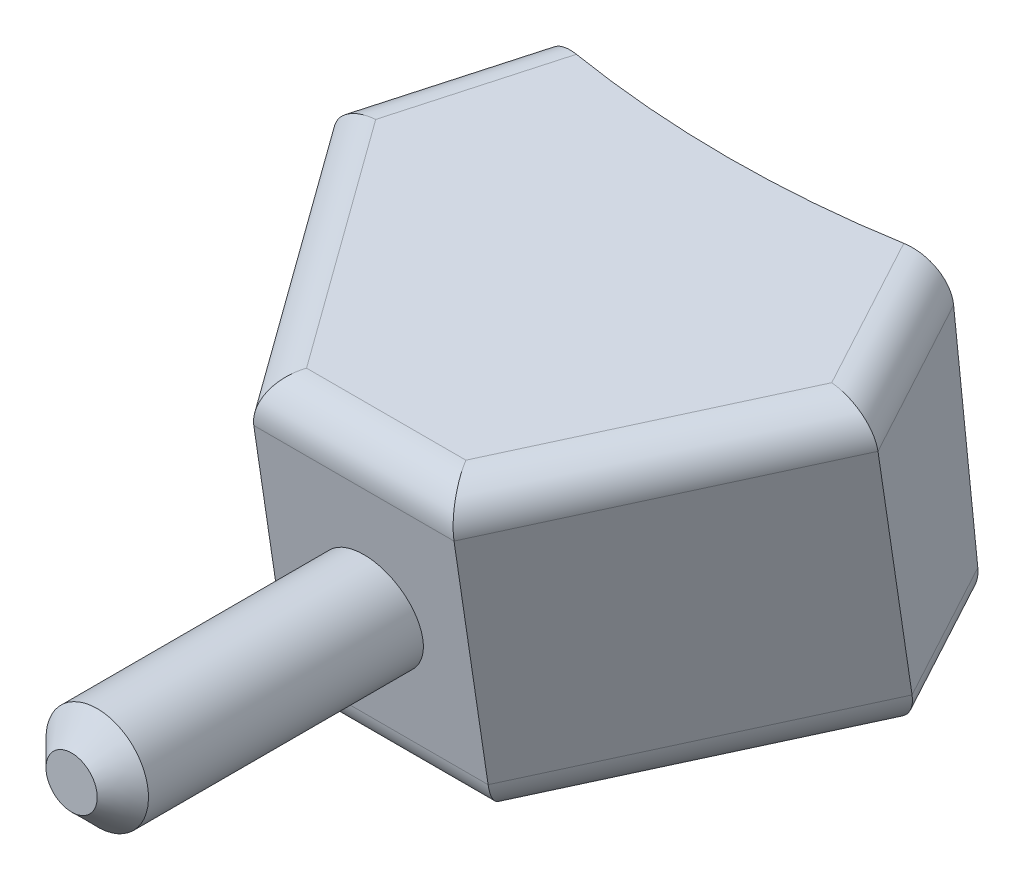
ISO-10303-21;
HEADER;
FILE_DESCRIPTION(('STEP AP214'),'2;1');
FILE_NAME('part.step','',(''),(''),'','','');
FILE_SCHEMA(('AUTOMOTIVE_DESIGN { 1 0 10303 214 1 1 1 1 }'));
ENDSEC;
DATA;
#1=APPLICATION_CONTEXT('core data for automotive mechanical design processes');
#2=APPLICATION_PROTOCOL_DEFINITION('international standard','automotive_design',2000,#1);
#3=PRODUCT_CONTEXT('',#1,'mechanical');
#4=PRODUCT('Part','Part','',(#3));
#5=PRODUCT_RELATED_PRODUCT_CATEGORY('part','',(#4));
#6=PRODUCT_DEFINITION_FORMATION('','',#4);
#7=PRODUCT_DEFINITION_CONTEXT('part definition',#1,'design');
#8=PRODUCT_DEFINITION('design','',#6,#7);
#9=PRODUCT_DEFINITION_SHAPE('','',#8);
#10=(LENGTH_UNIT() NAMED_UNIT(*) SI_UNIT(.MILLI.,.METRE.));
#11=(NAMED_UNIT(*) PLANE_ANGLE_UNIT() SI_UNIT($,.RADIAN.));
#12=(NAMED_UNIT(*) SI_UNIT($,.STERADIAN.) SOLID_ANGLE_UNIT());
#13=UNCERTAINTY_MEASURE_WITH_UNIT(LENGTH_MEASURE(1.E-05),#10,'distance_accuracy_value','');
#14=(GEOMETRIC_REPRESENTATION_CONTEXT(3) GLOBAL_UNCERTAINTY_ASSIGNED_CONTEXT((#13)) GLOBAL_UNIT_ASSIGNED_CONTEXT((#10,
#11,#12)) REPRESENTATION_CONTEXT('',''));
#15=CARTESIAN_POINT('',(0.,0.,0.));
#16=DIRECTION('',(0.,0.,1.));
#17=DIRECTION('',(1.,0.,0.));
#18=AXIS2_PLACEMENT_3D('',#15,#16,#17);
#19=CARTESIAN_POINT('',(1.95405117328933,-2.88864232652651,-0.468050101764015));
#20=DIRECTION('',(0.829037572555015,-0.0826539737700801,0.553050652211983));
#21=DIRECTION('',(0.554949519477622,0.,-0.831884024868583));
#22=AXIS2_PLACEMENT_3D('',#19,#20,#21);
#23=PLANE('',#22);
#24=DIRECTION('',(0.,0.98901586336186,0.14780941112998));
#25=VECTOR('',#24,1.);
#26=CARTESIAN_POINT('',(5.3092085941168,-2.15340499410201,-5.38763796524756));
#27=LINE('',#26,#25);
#28=CARTESIAN_POINT('',(5.30920859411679,-1.41164309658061,-5.27678090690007));
#29=VERTEX_POINT('',#28);
#30=CARTESIAN_POINT('',(5.30920859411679,3.03892828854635,-4.61163855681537));
#31=VERTEX_POINT('',#30);
#32=EDGE_CURVE('E133',#29,#31,#27,.T.);
#33=ORIENTED_EDGE('',*,*,#32,.T.);
#34=DIRECTION('',(0.559192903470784,0.122539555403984,-0.81993131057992));
#35=VECTOR('',#34,1.);
#36=CARTESIAN_POINT('',(1.95405117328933,2.30369095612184,0.307949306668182));
#37=LINE('',#36,#35);
#38=CARTESIAN_POINT('',(1.95405117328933,2.30369095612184,0.307949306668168));
#39=VERTEX_POINT('',#38);
#40=EDGE_CURVE('E223',#31,#39,#37,.F.);
#41=ORIENTED_EDGE('',*,*,#40,.T.);
#42=DIRECTION('',(0.,0.98901586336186,0.14780941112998));
#43=VECTOR('',#42,1.);
#44=CARTESIAN_POINT('',(1.95405117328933,-2.88864232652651,-0.468050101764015));
#45=LINE('',#44,#43);
#46=CARTESIAN_POINT('',(1.95405117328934,-2.14688042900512,-0.357193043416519));
#47=VERTEX_POINT('',#46);
#48=EDGE_CURVE('E135',#47,#39,#45,.T.);
#49=ORIENTED_EDGE('',*,*,#48,.F.);
#50=DIRECTION('',(0.559192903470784,0.122539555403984,-0.81993131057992));
#51=VECTOR('',#50,1.);
#52=CARTESIAN_POINT('',(1.95405117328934,-2.14688042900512,-0.357193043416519));
#53=LINE('',#52,#51);
#54=EDGE_CURVE('E131',#47,#29,#53,.T.);
#55=ORIENTED_EDGE('',*,*,#54,.T.);
#56=EDGE_LOOP('',(#33,#41,#49,#55));
#57=FACE_BOUND('',#56,.T.);
#58=ADVANCED_FACE('F38',(#57),#23,.T.);
#59=CARTESIAN_POINT('',(-1.95405117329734,-2.8886423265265,-0.468050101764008));
#60=DIRECTION('',(0.,-0.147809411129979,0.989015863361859));
#61=DIRECTION('',(0.,-0.989015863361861,-0.14780941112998));
#62=AXIS2_PLACEMENT_3D('',#59,#60,#61);
#63=PLANE('',#62);
#64=CARTESIAN_POINT('',(0.,0.,-0.0363396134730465));
#65=DIRECTION('',(0.,-0.147809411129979,0.989015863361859));
#66=DIRECTION('',(0.,0.989015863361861,0.14780941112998));
#67=AXIS2_PLACEMENT_3D('',#64,#65,#66);
#68=ELLIPSE('',#67,1.01110612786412,1.);
#69=CARTESIAN_POINT('',(0.,0.999999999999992,0.113111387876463));
#70=VERTEX_POINT('',#69);
#71=EDGE_CURVE('E168',#70,#70,#68,.T.);
#72=ORIENTED_EDGE('',*,*,#71,.F.);
#73=EDGE_LOOP('',(#72));
#74=FACE_BOUND('',#73,.T.);
#75=ORIENTED_EDGE('',*,*,#48,.T.);
#76=DIRECTION('',(0.999999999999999,0.,0.));
#77=VECTOR('',#76,1.);
#78=CARTESIAN_POINT('',(-1.95405117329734,2.30369095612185,0.307949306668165));
#79=LINE('',#78,#77);
#80=CARTESIAN_POINT('',(-1.95405117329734,2.30369095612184,0.307949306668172));
#81=VERTEX_POINT('',#80);
#82=EDGE_CURVE('E53',#39,#81,#79,.F.);
#83=ORIENTED_EDGE('',*,*,#82,.T.);
#84=DIRECTION('',(0.,0.98901586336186,0.14780941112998));
#85=VECTOR('',#84,1.);
#86=CARTESIAN_POINT('',(-1.95405117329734,-2.8886423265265,-0.468050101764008));
#87=LINE('',#86,#85);
#88=CARTESIAN_POINT('',(-1.95405117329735,-2.14688042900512,-0.357193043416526));
#89=VERTEX_POINT('',#88);
#90=EDGE_CURVE('E289',#89,#81,#87,.T.);
#91=ORIENTED_EDGE('',*,*,#90,.F.);
#92=DIRECTION('',(0.999999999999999,0.,0.));
#93=VECTOR('',#92,1.);
#94=CARTESIAN_POINT('',(-1.95405117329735,-2.14688042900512,-0.357193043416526));
#95=LINE('',#94,#93);
#96=EDGE_CURVE('E140',#89,#47,#95,.T.);
#97=ORIENTED_EDGE('',*,*,#96,.T.);
#98=EDGE_LOOP('',(#75,#83,#91,#97));
#99=FACE_BOUND('',#98,.T.);
#100=ADVANCED_FACE('F249',(#74,#99),#63,.T.);
#101=CARTESIAN_POINT('',(-5.30920859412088,-2.15340499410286,-5.38763796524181));
#102=DIRECTION('',(-0.829037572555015,-0.0826539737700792,0.553050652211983));
#103=DIRECTION('',(0.554949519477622,0.,0.831884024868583));
#104=AXIS2_PLACEMENT_3D('',#101,#102,#103);
#105=PLANE('',#104);
#106=ORIENTED_EDGE('',*,*,#90,.T.);
#107=DIRECTION('',(0.559192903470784,-0.122539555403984,0.81993131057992));
#108=VECTOR('',#107,1.);
#109=CARTESIAN_POINT('',(-5.30920859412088,3.0389282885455,-4.61163855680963));
#110=LINE('',#109,#108);
#111=CARTESIAN_POINT('',(-5.30920859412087,3.0389282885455,-4.61163855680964));
#112=VERTEX_POINT('',#111);
#113=EDGE_CURVE('E60',#81,#112,#110,.F.);
#114=ORIENTED_EDGE('',*,*,#113,.T.);
#115=DIRECTION('',(0.,0.98901586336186,0.14780941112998));
#116=VECTOR('',#115,1.);
#117=CARTESIAN_POINT('',(-5.30920859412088,-2.15340499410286,-5.38763796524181));
#118=LINE('',#117,#116);
#119=CARTESIAN_POINT('',(-5.30920859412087,-1.41164309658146,-5.27678090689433));
#120=VERTEX_POINT('',#119);
#121=EDGE_CURVE('E271',#120,#112,#118,.T.);
#122=ORIENTED_EDGE('',*,*,#121,.F.);
#123=DIRECTION('',(0.559192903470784,-0.122539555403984,0.81993131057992));
#124=VECTOR('',#123,1.);
#125=CARTESIAN_POINT('',(-5.30920859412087,-1.41164309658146,-5.27678090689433));
#126=LINE('',#125,#124);
#127=EDGE_CURVE('E310',#120,#89,#126,.T.);
#128=ORIENTED_EDGE('',*,*,#127,.T.);
#129=EDGE_LOOP('',(#106,#114,#122,#128));
#130=FACE_BOUND('',#129,.T.);
#131=ADVANCED_FACE('F253',(#130),#105,.T.);
#132=CARTESIAN_POINT('',(-3.96355649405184,-1.72686247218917,-8.24170062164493));
#133=DIRECTION('',(-0.906307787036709,0.0624669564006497,-0.41797616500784));
#134=DIRECTION('',(-0.418794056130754,0.,0.908081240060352));
#135=AXIS2_PLACEMENT_3D('',#132,#133,#134);
#136=PLANE('',#135);
#137=ORIENTED_EDGE('',*,*,#121,.T.);
#138=DIRECTION('',(-0.422618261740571,-0.13396082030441,0.896352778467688));
#139=VECTOR('',#138,1.);
#140=CARTESIAN_POINT('',(-3.96355649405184,3.46547081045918,-7.46570121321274));
#141=LINE('',#140,#139);
#142=CARTESIAN_POINT('',(-3.99221236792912,3.45638752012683,-7.4049234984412));
#143=VERTEX_POINT('',#142);
#144=EDGE_CURVE('E225',#112,#143,#141,.F.);
#145=ORIENTED_EDGE('',*,*,#144,.T.);
#146=CARTESIAN_POINT('',(-5.34935670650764,-32.2538576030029,-9.79912662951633));
#147=CARTESIAN_POINT('',(-5.23429851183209,-29.2154786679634,-9.59452131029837));
#148=CARTESIAN_POINT('',(-5.1191490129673,-26.1770899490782,-9.3901125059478));
#149=CARTESIAN_POINT('',(-4.88864559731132,-20.1002907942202,-8.98173489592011));
#150=CARTESIAN_POINT('',(-4.77329168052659,-17.0618803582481,-8.77776609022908));
#151=CARTESIAN_POINT('',(-4.54235761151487,-10.9850354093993,-8.37031543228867));
#152=CARTESIAN_POINT('',(-4.42677745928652,-7.94660089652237,-8.1668335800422));
#153=CARTESIAN_POINT('',(-4.19536378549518,-1.86970495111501,-7.76041523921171));
#154=CARTESIAN_POINT('',(-4.07953026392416,1.16875648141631,-7.55747875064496));
#155=CARTESIAN_POINT('',(-3.96355649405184,4.20723270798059,-7.35484415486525));
#156=B_SPLINE_CURVE_WITH_KNOTS('',3,(#146,#147,#148,#149,#150,#151,#152,#153,#154,#155),
.UNSPECIFIED.,.F.,.F.,(4,2,2,2,4),(0.,9.14229919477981,18.2845981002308,27.4268970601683,
36.5691963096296),.UNSPECIFIED.);
#157=CARTESIAN_POINT('',(-4.16402849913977,-1.04864585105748,-7.7056521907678));
#158=VERTEX_POINT('',#157);
#159=EDGE_CURVE('E266',#158,#143,#156,.T.);
#160=ORIENTED_EDGE('',*,*,#159,.F.);
#161=DIRECTION('',(-0.422618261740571,-0.13396082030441,0.896352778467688));
#162=VECTOR('',#161,1.);
#163=CARTESIAN_POINT('',(-3.96355649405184,-0.985100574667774,-8.13084356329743));
#164=LINE('',#163,#162);
#165=EDGE_CURVE('E294',#158,#120,#164,.T.);
#166=ORIENTED_EDGE('',*,*,#165,.T.);
#167=EDGE_LOOP('',(#137,#145,#160,#166));
#168=FACE_BOUND('',#167,.T.);
#169=ADVANCED_FACE('F260',(#168),#136,.T.);
#170=CARTESIAN_POINT('',(0.,7.40583048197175,-28.7571616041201));
#171=DIRECTION('',(0.,-0.98901586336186,-0.14780941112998));
#172=DIRECTION('',(0.,0.147809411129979,-0.98901586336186));
#173=AXIS2_PLACEMENT_3D('',#170,#171,#172);
#174=CONICAL_SURFACE('',#173,22.,0.0872664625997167);
#175=CARTESIAN_POINT('',(0.,7.40583048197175,-28.7571616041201));
#176=DIRECTION('',(0.,-0.98901586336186,-0.14780941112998));
#177=DIRECTION('',(0.,0.147809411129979,-0.98901586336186));
#178=AXIS2_PLACEMENT_3D('',#175,#176,#177);
#179=CIRCLE('',#178,22.);
#180=CARTESIAN_POINT('',(3.19511883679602,4.18850062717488,-7.22950487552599));
#181=VERTEX_POINT('',#180);
#182=CARTESIAN_POINT('',(-3.19511883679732,4.18850062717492,-7.22950487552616));
#183=VERTEX_POINT('',#182);
#184=EDGE_CURVE('E273',#181,#183,#179,.T.);
#185=ORIENTED_EDGE('',*,*,#184,.F.);
#186=CARTESIAN_POINT('',(3.19511883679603,4.18850062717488,-7.22950487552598));
#187=CARTESIAN_POINT('',(3.24057163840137,4.18951506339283,-7.23609626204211));
#188=CARTESIAN_POINT('',(3.28604171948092,4.18661436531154,-7.24308215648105));
#189=CARTESIAN_POINT('',(3.37575695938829,4.17321726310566,-7.25760322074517));
#190=CARTESIAN_POINT('',(3.42000219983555,4.16272136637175,-7.26513835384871));
#191=CARTESIAN_POINT('',(3.50603866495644,4.13436059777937,-7.28052338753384));
#192=CARTESIAN_POINT('',(3.54782850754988,4.11649162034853,-7.28837346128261));
#193=CARTESIAN_POINT('',(3.62769685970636,4.0738374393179,-7.30410028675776));
#194=CARTESIAN_POINT('',(3.66577668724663,4.04905470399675,-7.31197702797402));
#195=CARTESIAN_POINT('',(3.73671660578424,3.99347325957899,-7.3273797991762));
#196=CARTESIAN_POINT('',(3.76962482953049,3.9627368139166,-7.33490853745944));
#197=CARTESIAN_POINT('',(3.8296222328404,3.89588700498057,-7.34939446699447));
#198=CARTESIAN_POINT('',(3.85671014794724,3.8597724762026,-7.35635153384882));
#199=CARTESIAN_POINT('',(3.90339818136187,3.78434792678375,-7.36919528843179));
#200=CARTESIAN_POINT('',(3.92319798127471,3.74516575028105,-7.37510776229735));
#201=CARTESIAN_POINT('',(3.95568695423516,3.6638487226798,-7.38585363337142));
#202=CARTESIAN_POINT('',(3.96838658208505,3.62171831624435,-7.3906886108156));
#203=CARTESIAN_POINT('',(3.98146380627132,3.5586435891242,-7.39684738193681));
#204=CARTESIAN_POINT('',(3.98480384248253,3.53832370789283,-7.3986726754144));
#205=CARTESIAN_POINT('',(3.98978412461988,3.49748305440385,-7.40202432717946));
#206=CARTESIAN_POINT('',(3.99142686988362,3.47696262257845,-7.40355112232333));
#207=CARTESIAN_POINT('',(3.99221236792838,3.45638752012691,-7.40492349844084));
#208=B_SPLINE_CURVE_WITH_KNOTS('',3,(#186,#187,#188,#189,#190,#191,#192,#193,#194,#195,#196,
#197,#198,#199,#200,#201,#202,#203,#204,#205,#206,#207),.UNSPECIFIED.,.F.,.F.,(4,2,2,2,2,2,2,2,
2,2,4),(0.,0.137639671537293,0.275270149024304,0.412977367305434,0.550635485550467,
0.686924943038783,0.823243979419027,0.95548676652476,1.08753431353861,1.1494919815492,
1.21135828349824),.UNSPECIFIED.);
#209=CARTESIAN_POINT('',(3.99221236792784,3.45638752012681,-7.40492349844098));
#210=VERTEX_POINT('',#209);
#211=EDGE_CURVE('E211',#181,#210,#208,.T.);
#212=ORIENTED_EDGE('',*,*,#211,.T.);
#213=CARTESIAN_POINT('',(4.19264516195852,-1.79947860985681,-7.75581469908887));
#214=CARTESIAN_POINT('',(4.15449334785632,-0.798363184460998,-7.68892249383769));
#215=CARTESIAN_POINT('',(4.11632671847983,0.202753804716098,-7.62206217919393));
#216=CARTESIAN_POINT('',(4.03996382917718,2.20499091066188,-7.48840533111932));
#217=CARTESIAN_POINT('',(4.00176756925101,3.20611102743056,-7.42160879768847));
#218=CARTESIAN_POINT('',(3.96355649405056,4.20723270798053,-7.35484415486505));
#219=B_SPLINE_CURVE_WITH_KNOTS('',3,(#213,#214,#215,#216,#217,#218),.UNSPECIFIED.,.F.,.F.,(4,2,
4),(0.,3.01221844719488,6.02443689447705),.UNSPECIFIED.);
#220=CARTESIAN_POINT('',(4.1640284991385,-1.04864585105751,-7.70565219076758));
#221=VERTEX_POINT('',#220);
#222=EDGE_CURVE('E152',#221,#210,#219,.T.);
#223=ORIENTED_EDGE('',*,*,#222,.F.);
#224=CARTESIAN_POINT('',(4.16402849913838,-1.04864585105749,-7.70565219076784));
#225=CARTESIAN_POINT('',(4.16561897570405,-1.08933283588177,-7.70838088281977));
#226=CARTESIAN_POINT('',(4.16378461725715,-1.13019070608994,-7.71046855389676));
#227=CARTESIAN_POINT('',(4.1534327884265,-1.2110635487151,-7.71334403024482));
#228=CARTESIAN_POINT('',(4.14492085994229,-1.25107919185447,-7.71413291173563));
#229=CARTESIAN_POINT('',(4.12137369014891,-1.32918355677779,-7.71439766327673));
#230=CARTESIAN_POINT('',(4.10633354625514,-1.36727080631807,-7.71387254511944));
#231=CARTESIAN_POINT('',(4.07017547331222,-1.44038693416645,-7.71156681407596));
#232=CARTESIAN_POINT('',(4.0490589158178,-1.47541650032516,-7.709786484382));
#233=CARTESIAN_POINT('',(4.0014238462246,-1.5413833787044,-7.70508381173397));
#234=CARTESIAN_POINT('',(3.97491675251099,-1.57232911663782,-7.70216387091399));
#235=CARTESIAN_POINT('',(3.91725914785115,-1.62941050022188,-7.69533098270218));
#236=CARTESIAN_POINT('',(3.88610804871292,-1.65554553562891,-7.69141790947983));
#237=CARTESIAN_POINT('',(3.8194776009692,-1.70279761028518,-7.682696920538));
#238=CARTESIAN_POINT('',(3.78393106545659,-1.72381702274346,-7.67787431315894));
#239=CARTESIAN_POINT('',(3.70996673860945,-1.75978194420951,-7.66757521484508));
#240=CARTESIAN_POINT('',(3.67154822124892,-1.77472591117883,-7.66209855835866));
#241=CARTESIAN_POINT('',(3.59879852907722,-1.79650956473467,-7.65154304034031));
#242=CARTESIAN_POINT('',(3.56471689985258,-1.80422779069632,-7.64652743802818));
#243=CARTESIAN_POINT('',(3.49591419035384,-1.81503739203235,-7.63628020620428));
#244=CARTESIAN_POINT('',(3.46119419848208,-1.81813601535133,-7.63104892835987));
#245=CARTESIAN_POINT('',(3.42643137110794,-1.81891560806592,-7.62575870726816));
#246=B_SPLINE_CURVE_WITH_KNOTS('',3,(#224,#225,#226,#227,#228,#229,#230,#231,#232,#233,#234,
#235,#236,#237,#238,#239,#240,#241,#242,#243,#244,#245),.UNSPECIFIED.,.F.,.F.,(4,2,2,2,2,2,2,2,
2,2,4),(0.,0.122278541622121,0.244455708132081,0.366724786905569,0.488966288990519,
0.610951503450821,0.73295218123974,0.857125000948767,0.981329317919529,1.0869325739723,
1.19236996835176),.UNSPECIFIED.);
#247=CARTESIAN_POINT('',(3.42643137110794,-1.81891560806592,-7.62575870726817));
#248=VERTEX_POINT('',#247);
#249=EDGE_CURVE('E166',#221,#248,#246,.T.);
#250=ORIENTED_EDGE('',*,*,#249,.T.);
#251=CARTESIAN_POINT('',(0.,1.47173530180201,-29.6440180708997));
#252=DIRECTION('',(0.,-0.98901586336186,-0.14780941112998));
#253=DIRECTION('',(0.,0.147809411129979,-0.98901586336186));
#254=AXIS2_PLACEMENT_3D('',#251,#252,#253);
#255=CIRCLE('',#254,22.5249319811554);
#256=CARTESIAN_POINT('',(-3.42643137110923,-1.81891560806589,-7.62575870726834));
#257=VERTEX_POINT('',#256);
#258=EDGE_CURVE('E153',#248,#257,#255,.T.);
#259=ORIENTED_EDGE('',*,*,#258,.T.);
#260=CARTESIAN_POINT('',(-3.42643137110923,-1.81891560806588,-7.62575870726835));
#261=CARTESIAN_POINT('',(-3.46991835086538,-1.81796073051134,-7.63237518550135));
#262=CARTESIAN_POINT('',(-3.5133543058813,-1.81334410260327,-7.63890381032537));
#263=CARTESIAN_POINT('',(-3.59894637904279,-1.79691123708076,-7.65157585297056));
#264=CARTESIAN_POINT('',(-3.64110108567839,-1.78508734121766,-7.65771885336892));
#265=CARTESIAN_POINT('',(-3.72291801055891,-1.75434277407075,-7.66940412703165));
#266=CARTESIAN_POINT('',(-3.76257629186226,-1.73541120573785,-7.6749454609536));
#267=CARTESIAN_POINT('',(-3.83804993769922,-1.6908897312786,-7.68517528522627));
#268=CARTESIAN_POINT('',(-3.87386843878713,-1.66530531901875,-7.68986447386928));
#269=CARTESIAN_POINT('',(-3.93941899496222,-1.60907601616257,-7.69802924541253));
#270=CARTESIAN_POINT('',(-3.96931117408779,-1.57862287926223,-7.70153935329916));
#271=CARTESIAN_POINT('',(-4.02345449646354,-1.51294427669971,-7.70736471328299));
#272=CARTESIAN_POINT('',(-4.04770524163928,-1.47771847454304,-7.70967988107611));
#273=CARTESIAN_POINT('',(-4.08905079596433,-1.40481912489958,-7.71291547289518));
#274=CARTESIAN_POINT('',(-4.10636027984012,-1.3672690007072,-7.71388050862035));
#275=CARTESIAN_POINT('',(-4.13444854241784,-1.28979952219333,-7.71448334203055));
#276=CARTESIAN_POINT('',(-4.14523122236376,-1.24988159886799,-7.71412193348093));
#277=CARTESIAN_POINT('',(-4.1574402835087,-1.18286470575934,-7.71241586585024));
#278=CARTESIAN_POINT('',(-4.16081101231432,-1.15609314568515,-7.71145333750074));
#279=CARTESIAN_POINT('',(-4.16461667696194,-1.10240829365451,-7.70896854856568));
#280=CARTESIAN_POINT('',(-4.16505601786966,-1.07549527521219,-7.7074471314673));
#281=CARTESIAN_POINT('',(-4.16402849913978,-1.04864585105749,-7.70565219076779));
#282=B_SPLINE_CURVE_WITH_KNOTS('',3,(#260,#261,#262,#263,#264,#265,#266,#267,#268,#269,#270,
#271,#272,#273,#274,#275,#276,#277,#278,#279,#280,#281),.UNSPECIFIED.,.F.,.F.,(4,2,2,2,2,2,2,2,
2,2,4),(0.,0.131872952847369,0.263886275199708,0.396102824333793,0.528210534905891,
0.656019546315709,0.783837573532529,0.907323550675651,1.03073564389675,1.1115813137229,
1.19230546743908),.UNSPECIFIED.);
#283=EDGE_CURVE('E167',#257,#158,#282,.T.);
#284=ORIENTED_EDGE('',*,*,#283,.T.);
#285=ORIENTED_EDGE('',*,*,#159,.T.);
#286=CARTESIAN_POINT('',(-3.99221236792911,3.45638752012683,-7.4049234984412));
#287=CARTESIAN_POINT('',(-3.99064498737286,3.49843863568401,-7.40212871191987));
#288=CARTESIAN_POINT('',(-3.98542502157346,3.54027398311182,-7.39866959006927));
#289=CARTESIAN_POINT('',(-3.96810644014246,3.62229193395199,-7.39060250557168));
#290=CARTESIAN_POINT('',(-3.95602248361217,3.66247786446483,-7.38599700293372));
#291=CARTESIAN_POINT('',(-3.92539641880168,3.74015382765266,-7.37580501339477));
#292=CARTESIAN_POINT('',(-3.90685605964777,3.77764458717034,-7.37021879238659));
#293=CARTESIAN_POINT('',(-3.86393480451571,3.84898728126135,-7.35828171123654));
#294=CARTESIAN_POINT('',(-3.83955245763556,3.88283830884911,-7.35193066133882));
#295=CARTESIAN_POINT('',(-3.78501727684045,3.94684869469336,-7.33853689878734));
#296=CARTESIAN_POINT('',(-3.75473755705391,3.97689711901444,-7.33148104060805));
#297=CARTESIAN_POINT('',(-3.68969625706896,4.03159346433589,-7.31707265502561));
#298=CARTESIAN_POINT('',(-3.65493338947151,4.05623982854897,-7.30972004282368));
#299=CARTESIAN_POINT('',(-3.58059594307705,4.10033375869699,-7.29471326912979));
#300=CARTESIAN_POINT('',(-3.54089501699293,4.11956764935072,-7.28705760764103));
#301=CARTESIAN_POINT('',(-3.45882484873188,4.15119114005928,-7.27196573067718));
#302=CARTESIAN_POINT('',(-3.41645663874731,4.16358336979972,-7.26452943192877));
#303=CARTESIAN_POINT('',(-3.34407538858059,4.17840482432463,-7.25243145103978));
#304=CARTESIAN_POINT('',(-3.3144619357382,4.18275525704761,-7.24764535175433));
#305=CARTESIAN_POINT('',(-3.25493854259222,4.18812625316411,-7.23835288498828));
#306=CARTESIAN_POINT('',(-3.22502913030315,4.18915194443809,-7.23384609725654));
#307=CARTESIAN_POINT('',(-3.19511883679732,4.18850062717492,-7.22950487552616));
#308=B_SPLINE_CURVE_WITH_KNOTS('',3,(#286,#287,#288,#289,#290,#291,#292,#293,#294,#295,#296,
#297,#298,#299,#300,#301,#302,#303,#304,#305,#306,#307),.UNSPECIFIED.,.F.,.F.,(4,2,2,2,2,2,2,2,
2,2,4),(0.,0.126311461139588,0.252354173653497,0.378362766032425,0.504402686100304,
0.63353456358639,0.762703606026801,0.896422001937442,1.0300889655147,1.12084942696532,
1.21146983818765),.UNSPECIFIED.);
#309=EDGE_CURVE('E217',#143,#183,#308,.T.);
#310=ORIENTED_EDGE('',*,*,#309,.T.);
#311=EDGE_LOOP('',(#185,#212,#223,#250,#259,#284,#285,#310));
#312=FACE_BOUND('',#311,.T.);
#313=ADVANCED_FACE('F190',(#312),#174,.F.);
#314=CARTESIAN_POINT('',(5.3092085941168,-2.15340499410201,-5.38763796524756));
#315=DIRECTION('',(0.906307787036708,0.0624669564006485,-0.417976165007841));
#316=DIRECTION('',(-0.418794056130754,0.,-0.908081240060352));
#317=AXIS2_PLACEMENT_3D('',#314,#315,#316);
#318=PLANE('',#317);
#319=ORIENTED_EDGE('',*,*,#222,.T.);
#320=DIRECTION('',(-0.422618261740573,0.13396082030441,-0.896352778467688));
#321=VECTOR('',#320,1.);
#322=CARTESIAN_POINT('',(5.3092085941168,3.03892828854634,-4.61163855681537));
#323=LINE('',#322,#321);
#324=EDGE_CURVE('E151',#210,#31,#323,.F.);
#325=ORIENTED_EDGE('',*,*,#324,.T.);
#326=ORIENTED_EDGE('',*,*,#32,.F.);
#327=DIRECTION('',(-0.422618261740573,0.13396082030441,-0.896352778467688));
#328=VECTOR('',#327,1.);
#329=CARTESIAN_POINT('',(5.30920859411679,-1.41164309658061,-5.27678090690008));
#330=LINE('',#329,#328);
#331=EDGE_CURVE('E148',#29,#221,#330,.T.);
#332=ORIENTED_EDGE('',*,*,#331,.T.);
#333=EDGE_LOOP('',(#319,#325,#326,#332));
#334=FACE_BOUND('',#333,.T.);
#335=ADVANCED_FACE('F146',(#334),#318,.T.);
#336=CARTESIAN_POINT('',(0.,1.47173530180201,-29.6440180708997));
#337=DIRECTION('',(0.,-0.98901586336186,-0.14780941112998));
#338=DIRECTION('',(0.,0.147809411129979,-0.98901586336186));
#339=AXIS2_PLACEMENT_3D('',#336,#337,#338);
#340=PLANE('',#339);
#341=ORIENTED_EDGE('',*,*,#258,.F.);
#342=DIRECTION('',(-0.422618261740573,0.13396082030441,-0.896352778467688));
#343=VECTOR('',#342,1.);
#344=CARTESIAN_POINT('',(-5.71269645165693,1.07798963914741,-27.0094043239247));
#345=LINE('',#344,#343);
#346=CARTESIAN_POINT('',(4.45014832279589,-2.14341167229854,-5.45450484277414));
#347=VERTEX_POINT('',#346);
#348=EDGE_CURVE('E141',#248,#347,#345,.F.);
#349=ORIENTED_EDGE('',*,*,#348,.T.);
#350=DIRECTION('',(0.559192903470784,0.122539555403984,-0.81993131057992));
#351=VECTOR('',#350,1.);
#352=CARTESIAN_POINT('',(14.3972094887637,0.0363521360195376,-20.0396450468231));
#353=LINE('',#352,#351);
#354=CARTESIAN_POINT('',(1.55526909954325,-2.77778526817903,-1.20981199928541));
#355=VERTEX_POINT('',#354);
#356=EDGE_CURVE('E159',#347,#355,#353,.F.);
#357=ORIENTED_EDGE('',*,*,#356,.T.);
#358=DIRECTION('',(0.999999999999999,0.,0.));
#359=VECTOR('',#358,1.);
#360=CARTESIAN_POINT('',(0.,-2.77778526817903,-1.2098119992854));
#361=LINE('',#360,#359);
#362=CARTESIAN_POINT('',(-1.55526909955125,-2.77778526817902,-1.2098119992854));
#363=VERTEX_POINT('',#362);
#364=EDGE_CURVE('E332',#355,#363,#361,.F.);
#365=ORIENTED_EDGE('',*,*,#364,.T.);
#366=DIRECTION('',(0.559192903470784,-0.122539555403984,0.81993131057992));
#367=VECTOR('',#366,1.);
#368=CARTESIAN_POINT('',(-14.3972094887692,0.0363521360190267,-20.0396450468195));
#369=LINE('',#368,#367);
#370=CARTESIAN_POINT('',(-4.45014832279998,-2.1434116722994,-5.45450484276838));
#371=VERTEX_POINT('',#370);
#372=EDGE_CURVE('E442',#363,#371,#369,.F.);
#373=ORIENTED_EDGE('',*,*,#372,.T.);
#374=DIRECTION('',(-0.422618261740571,-0.13396082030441,0.896352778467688));
#375=VECTOR('',#374,1.);
#376=CARTESIAN_POINT('',(5.71269645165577,1.07798963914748,-27.0094043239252));
#377=LINE('',#376,#375);
#378=EDGE_CURVE('E320',#371,#257,#377,.F.);
#379=ORIENTED_EDGE('',*,*,#378,.T.);
#380=EDGE_LOOP('',(#341,#349,#357,#365,#373,#379));
#381=FACE_BOUND('',#380,.T.);
#382=ADVANCED_FACE('F259',(#381),#340,.T.);
#383=CARTESIAN_POINT('',(0.,7.40583048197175,-28.7571616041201));
#384=DIRECTION('',(0.,-0.98901586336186,-0.14780941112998));
#385=DIRECTION('',(0.,0.147809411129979,-0.98901586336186));
#386=AXIS2_PLACEMENT_3D('',#383,#384,#385);
#387=PLANE('',#386);
#388=DIRECTION('',(0.559192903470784,0.122539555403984,-0.81993131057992));
#389=VECTOR('',#388,1.);
#390=CARTESIAN_POINT('',(4.68743041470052,3.8426806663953,-4.91556948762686));
#391=LINE('',#390,#389);
#392=CARTESIAN_POINT('',(1.55526909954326,3.15630991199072,-0.322955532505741));
#393=VERTEX_POINT('',#392);
#394=CARTESIAN_POINT('',(4.45014832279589,3.7906835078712,-4.56764837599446));
#395=VERTEX_POINT('',#394);
#396=EDGE_CURVE('E315',#393,#395,#391,.T.);
#397=ORIENTED_EDGE('',*,*,#396,.T.);
#398=DIRECTION('',(-0.422618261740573,0.13396082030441,-0.896352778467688));
#399=VECTOR('',#398,1.);
#400=CARTESIAN_POINT('',(3.28382565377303,4.16038249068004,-7.04136203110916));
#401=LINE('',#400,#399);
#402=EDGE_CURVE('E316',#395,#181,#401,.T.);
#403=ORIENTED_EDGE('',*,*,#402,.T.);
#404=ORIENTED_EDGE('',*,*,#184,.T.);
#405=DIRECTION('',(-0.422618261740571,-0.13396082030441,0.896352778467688));
#406=VECTOR('',#405,1.);
#407=CARTESIAN_POINT('',(-4.62947775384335,3.7338399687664,-4.18729937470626));
#408=LINE('',#407,#406);
#409=CARTESIAN_POINT('',(-4.45014832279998,3.79068350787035,-4.56764837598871));
#410=VERTEX_POINT('',#409);
#411=EDGE_CURVE('E308',#183,#410,#408,.T.);
#412=ORIENTED_EDGE('',*,*,#411,.T.);
#413=DIRECTION('',(0.559192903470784,-0.122539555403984,0.81993131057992));
#414=VECTOR('',#413,1.);
#415=CARTESIAN_POINT('',(-1.33227299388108,3.1074433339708,0.00401837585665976));
#416=LINE('',#415,#414);
#417=CARTESIAN_POINT('',(-1.55526909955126,3.15630991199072,-0.322955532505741));
#418=VERTEX_POINT('',#417);
#419=EDGE_CURVE('E304',#410,#418,#416,.T.);
#420=ORIENTED_EDGE('',*,*,#419,.T.);
#421=DIRECTION('',(0.999999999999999,0.,0.));
#422=VECTOR('',#421,1.);
#423=CARTESIAN_POINT('',(1.95405117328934,3.15630991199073,-0.322955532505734));
#424=LINE('',#423,#422);
#425=EDGE_CURVE('E306',#418,#393,#424,.T.);
#426=ORIENTED_EDGE('',*,*,#425,.T.);
#427=EDGE_LOOP('',(#397,#403,#404,#412,#420,#426));
#428=FACE_BOUND('',#427,.T.);
#429=ADVANCED_FACE('F357',(#428),#387,.F.);
#430=CARTESIAN_POINT('',(-1.54027832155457E-10,-3.37556371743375E-10,-499999.999999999));
#431=DIRECTION('',(0.,0.,0.999999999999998));
#432=DIRECTION('',(0.999999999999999,0.,0.));
#433=AXIS2_PLACEMENT_3D('',#430,#431,#432);
#434=CYLINDRICAL_SURFACE('',#433,1.);
#435=CARTESIAN_POINT('',(0.,0.,5.31770900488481));
#436=DIRECTION('',(0.,0.,-0.999999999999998));
#437=DIRECTION('',(-0.999999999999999,0.,0.));
#438=AXIS2_PLACEMENT_3D('',#435,#436,#437);
#439=CIRCLE('',#438,1.);
#440=CARTESIAN_POINT('',(-1.,0.,5.31770900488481));
#441=VERTEX_POINT('',#440);
#442=EDGE_CURVE('E11',#441,#441,#439,.T.);
#443=ORIENTED_EDGE('',*,*,#442,.T.);
#444=EDGE_LOOP('',(#443));
#445=FACE_BOUND('',#444,.T.);
#446=ORIENTED_EDGE('',*,*,#71,.T.);
#447=EDGE_LOOP('',(#446));
#448=FACE_BOUND('',#447,.T.);
#449=ADVANCED_FACE('F201',(#445,#448),#434,.T.);
#450=CARTESIAN_POINT('',(0.,0.,5.81770900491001));
#451=DIRECTION('',(0.,0.,-0.999999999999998));
#452=DIRECTION('',(-0.999999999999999,0.,0.));
#453=AXIS2_PLACEMENT_3D('',#450,#451,#452);
#454=PLANE('',#453);
#455=CARTESIAN_POINT('',(0.,0.,5.81770900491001));
#456=DIRECTION('',(0.,0.,-0.999999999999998));
#457=DIRECTION('',(-0.999999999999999,0.,0.));
#458=AXIS2_PLACEMENT_3D('',#455,#456,#457);
#459=CIRCLE('',#458,0.499999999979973);
#460=CARTESIAN_POINT('',(-0.49999999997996,0.,5.81770900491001));
#461=VERTEX_POINT('',#460);
#462=EDGE_CURVE('E46',#461,#461,#459,.F.);
#463=ORIENTED_EDGE('',*,*,#462,.T.);
#464=EDGE_LOOP('',(#463));
#465=FACE_BOUND('',#464,.T.);
#466=ADVANCED_FACE('F199',(#465),#454,.F.);
#467=CARTESIAN_POINT('',(-3.2838256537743,-1.03195079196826,-7.81736143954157));
#468=DIRECTION('',(-0.422618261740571,-0.13396082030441,0.896352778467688));
#469=DIRECTION('',(0.90450542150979,0.,0.426462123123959));
#470=AXIS2_PLACEMENT_3D('',#467,#468,#469);
#471=CYLINDRICAL_SURFACE('',#470,0.75);
#472=ORIENTED_EDGE('',*,*,#283,.F.);
#473=ORIENTED_EDGE('',*,*,#378,.F.);
#474=CARTESIAN_POINT('',(-4.45014832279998,-1.40164977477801,-5.3436477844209));
#475=DIRECTION('',(0.0784590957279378,-0.147353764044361,0.985967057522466));
#476=DIRECTION('',(-0.99691733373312,-0.0115969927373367,0.0775972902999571));
#477=AXIS2_PLACEMENT_3D('',#474,#475,#476);
#478=ELLIPSE('',#477,0.86171665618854,0.75);
#479=EDGE_CURVE('E278',#120,#371,#478,.T.);
#480=ORIENTED_EDGE('',*,*,#479,.F.);
#481=ORIENTED_EDGE('',*,*,#165,.F.);
#482=EDGE_LOOP('',(#472,#473,#480,#481));
#483=FACE_BOUND('',#482,.T.);
#484=ADVANCED_FACE('F193',(#483),#471,.T.);
#485=CARTESIAN_POINT('',(-4.68743041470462,-1.3496526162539,-5.6915688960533));
#486=DIRECTION('',(0.559192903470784,-0.122539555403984,0.81993131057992));
#487=DIRECTION('',(0.826157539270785,0.,-0.563439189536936));
#488=AXIS2_PLACEMENT_3D('',#485,#486,#487);
#489=CYLINDRICAL_SURFACE('',#488,0.75);
#490=ORIENTED_EDGE('',*,*,#479,.T.);
#491=ORIENTED_EDGE('',*,*,#372,.F.);
#492=CARTESIAN_POINT('',(-1.55526909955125,-2.03602337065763,-1.09895494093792));
#493=DIRECTION('',(0.882947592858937,-0.069392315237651,0.46431482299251));
#494=DIRECTION('',(-0.46947156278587,-0.130507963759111,0.873249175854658));
#495=AXIS2_PLACEMENT_3D('',#492,#493,#494);
#496=ELLIPSE('',#495,0.849427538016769,0.75);
#497=EDGE_CURVE('E285',#89,#363,#496,.T.);
#498=ORIENTED_EDGE('',*,*,#497,.F.);
#499=ORIENTED_EDGE('',*,*,#127,.F.);
#500=EDGE_LOOP('',(#490,#491,#498,#499));
#501=FACE_BOUND('',#500,.T.);
#502=ADVANCED_FACE('F198',(#501),#489,.T.);
#503=CARTESIAN_POINT('',(-1.95405117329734,-2.03602337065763,-1.09895494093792));
#504=DIRECTION('',(0.999999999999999,0.,0.));
#505=DIRECTION('',(0.,0.,-0.999999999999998));
#506=AXIS2_PLACEMENT_3D('',#503,#504,#505);
#507=CYLINDRICAL_SURFACE('',#506,0.75);
#508=ORIENTED_EDGE('',*,*,#497,.T.);
#509=ORIENTED_EDGE('',*,*,#364,.F.);
#510=CARTESIAN_POINT('',(1.55526909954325,-2.03602337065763,-1.09895494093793));
#511=DIRECTION('',(0.882947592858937,0.0693923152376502,-0.464314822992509));
#512=DIRECTION('',(0.46947156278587,-0.130507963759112,0.873249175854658));
#513=AXIS2_PLACEMENT_3D('',#510,#511,#512);
#514=ELLIPSE('',#513,0.849427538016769,0.75);
#515=EDGE_CURVE('E162',#47,#355,#514,.T.);
#516=ORIENTED_EDGE('',*,*,#515,.F.);
#517=ORIENTED_EDGE('',*,*,#96,.F.);
#518=EDGE_LOOP('',(#508,#509,#516,#517));
#519=FACE_BOUND('',#518,.T.);
#520=ADVANCED_FACE('F331',(#519),#507,.T.);
#521=CARTESIAN_POINT('',(1.33227299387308,-2.08488994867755,-0.77198103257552));
#522=DIRECTION('',(0.559192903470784,0.122539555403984,-0.81993131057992));
#523=DIRECTION('',(-0.826157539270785,0.,-0.563439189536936));
#524=AXIS2_PLACEMENT_3D('',#521,#522,#523);
#525=CYLINDRICAL_SURFACE('',#524,0.75);
#526=ORIENTED_EDGE('',*,*,#515,.T.);
#527=ORIENTED_EDGE('',*,*,#356,.F.);
#528=CARTESIAN_POINT('',(4.45014832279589,-1.40164977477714,-5.34364778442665));
#529=DIRECTION('',(0.0784590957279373,0.147353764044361,-0.985967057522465));
#530=DIRECTION('',(0.99691733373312,-0.0115969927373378,0.0775972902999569));
#531=AXIS2_PLACEMENT_3D('',#528,#529,#530);
#532=ELLIPSE('',#531,0.86171665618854,0.75);
#533=EDGE_CURVE('E157',#29,#347,#532,.T.);
#534=ORIENTED_EDGE('',*,*,#533,.F.);
#535=ORIENTED_EDGE('',*,*,#54,.F.);
#536=EDGE_LOOP('',(#526,#527,#534,#535));
#537=FACE_BOUND('',#536,.T.);
#538=ADVANCED_FACE('F158',(#537),#525,.T.);
#539=CARTESIAN_POINT('',(4.62947775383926,-1.45849331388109,-4.96329878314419));
#540=DIRECTION('',(-0.422618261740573,0.13396082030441,-0.896352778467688));
#541=DIRECTION('',(-0.90450542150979,0.,0.42646212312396));
#542=AXIS2_PLACEMENT_3D('',#539,#540,#541);
#543=CYLINDRICAL_SURFACE('',#542,0.75);
#544=ORIENTED_EDGE('',*,*,#533,.T.);
#545=ORIENTED_EDGE('',*,*,#348,.F.);
#546=ORIENTED_EDGE('',*,*,#249,.F.);
#547=ORIENTED_EDGE('',*,*,#331,.F.);
#548=EDGE_LOOP('',(#544,#545,#546,#547));
#549=FACE_BOUND('',#548,.T.);
#550=ADVANCED_FACE('F165',(#549),#543,.T.);
#551=CARTESIAN_POINT('',(5.71269645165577,6.27032292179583,-26.233404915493));
#552=DIRECTION('',(0.422618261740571,0.13396082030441,-0.896352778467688));
#553=DIRECTION('',(-0.90450542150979,0.,-0.426462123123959));
#554=AXIS2_PLACEMENT_3D('',#551,#552,#553);
#555=CYLINDRICAL_SURFACE('',#554,0.75);
#556=ORIENTED_EDGE('',*,*,#309,.F.);
#557=ORIENTED_EDGE('',*,*,#144,.F.);
#558=CARTESIAN_POINT('',(-4.45014832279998,3.04892161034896,-4.67850543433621));
#559=DIRECTION('',(-0.0784590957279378,0.147353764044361,-0.985967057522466));
#560=DIRECTION('',(-0.99691733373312,-0.0115969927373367,0.0775972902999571));
#561=AXIS2_PLACEMENT_3D('',#558,#559,#560);
#562=ELLIPSE('',#561,0.86171665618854,0.75);
#563=EDGE_CURVE('E163',#410,#112,#562,.F.);
#564=ORIENTED_EDGE('',*,*,#563,.F.);
#565=ORIENTED_EDGE('',*,*,#411,.F.);
#566=EDGE_LOOP('',(#556,#557,#564,#565));
#567=FACE_BOUND('',#566,.T.);
#568=ADVANCED_FACE('F299',(#567),#555,.T.);
#569=CARTESIAN_POINT('',(-14.3972094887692,5.22868541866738,-19.2636456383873));
#570=DIRECTION('',(-0.559192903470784,0.122539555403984,-0.81993131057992));
#571=DIRECTION('',(-0.826157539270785,0.,0.563439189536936));
#572=AXIS2_PLACEMENT_3D('',#569,#570,#571);
#573=CYLINDRICAL_SURFACE('',#572,0.75);
#574=ORIENTED_EDGE('',*,*,#563,.T.);
#575=ORIENTED_EDGE('',*,*,#113,.F.);
#576=CARTESIAN_POINT('',(-1.55526909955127,2.41454801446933,-0.433812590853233));
#577=DIRECTION('',(-0.882947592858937,0.069392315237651,-0.46431482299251));
#578=DIRECTION('',(0.46947156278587,0.130507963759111,-0.873249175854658));
#579=AXIS2_PLACEMENT_3D('',#576,#577,#578);
#580=ELLIPSE('',#579,0.849427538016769,0.75);
#581=EDGE_CURVE('E235',#418,#81,#580,.F.);
#582=ORIENTED_EDGE('',*,*,#581,.F.);
#583=ORIENTED_EDGE('',*,*,#419,.F.);
#584=EDGE_LOOP('',(#574,#575,#582,#583));
#585=FACE_BOUND('',#584,.T.);
#586=ADVANCED_FACE('F302',(#585),#573,.T.);
#587=CARTESIAN_POINT('',(0.,2.41454801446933,-0.433812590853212));
#588=DIRECTION('',(-0.999999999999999,0.,0.));
#589=DIRECTION('',(0.,0.,0.999999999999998));
#590=AXIS2_PLACEMENT_3D('',#587,#588,#589);
#591=CYLINDRICAL_SURFACE('',#590,0.75);
#592=ORIENTED_EDGE('',*,*,#581,.T.);
#593=ORIENTED_EDGE('',*,*,#82,.F.);
#594=CARTESIAN_POINT('',(1.55526909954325,2.41454801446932,-0.433812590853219));
#595=DIRECTION('',(-0.882947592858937,-0.0693923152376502,0.464314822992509));
#596=DIRECTION('',(-0.46947156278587,0.130507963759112,-0.873249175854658));
#597=AXIS2_PLACEMENT_3D('',#594,#595,#596);
#598=ELLIPSE('',#597,0.849427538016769,0.75);
#599=EDGE_CURVE('E232',#393,#39,#598,.F.);
#600=ORIENTED_EDGE('',*,*,#599,.F.);
#601=ORIENTED_EDGE('',*,*,#425,.F.);
#602=EDGE_LOOP('',(#592,#593,#600,#601));
#603=FACE_BOUND('',#602,.T.);
#604=ADVANCED_FACE('F414',(#603),#591,.T.);
#605=CARTESIAN_POINT('',(14.3972094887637,5.22868541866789,-19.2636456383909));
#606=DIRECTION('',(-0.559192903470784,-0.122539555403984,0.81993131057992));
#607=DIRECTION('',(0.826157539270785,0.,0.563439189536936));
#608=AXIS2_PLACEMENT_3D('',#605,#606,#607);
#609=CYLINDRICAL_SURFACE('',#608,0.75);
#610=ORIENTED_EDGE('',*,*,#599,.T.);
#611=ORIENTED_EDGE('',*,*,#40,.F.);
#612=CARTESIAN_POINT('',(4.45014832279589,3.0489216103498,-4.67850543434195));
#613=DIRECTION('',(-0.0784590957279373,-0.147353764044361,0.985967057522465));
#614=DIRECTION('',(-0.99691733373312,0.0115969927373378,-0.0775972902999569));
#615=AXIS2_PLACEMENT_3D('',#612,#613,#614);
#616=ELLIPSE('',#615,0.86171665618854,0.75);
#617=EDGE_CURVE('E229',#395,#31,#616,.F.);
#618=ORIENTED_EDGE('',*,*,#617,.F.);
#619=ORIENTED_EDGE('',*,*,#396,.F.);
#620=EDGE_LOOP('',(#610,#611,#618,#619));
#621=FACE_BOUND('',#620,.T.);
#622=ADVANCED_FACE('F207',(#621),#609,.T.);
#623=CARTESIAN_POINT('',(-5.71269645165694,6.27032292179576,-26.2334049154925));
#624=DIRECTION('',(0.422618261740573,-0.13396082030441,0.896352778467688));
#625=DIRECTION('',(0.90450542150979,0.,-0.42646212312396));
#626=AXIS2_PLACEMENT_3D('',#623,#624,#625);
#627=CYLINDRICAL_SURFACE('',#626,0.75);
#628=ORIENTED_EDGE('',*,*,#617,.T.);
#629=ORIENTED_EDGE('',*,*,#324,.F.);
#630=ORIENTED_EDGE('',*,*,#211,.F.);
#631=ORIENTED_EDGE('',*,*,#402,.F.);
#632=EDGE_LOOP('',(#628,#629,#630,#631));
#633=FACE_BOUND('',#632,.T.);
#634=ADVANCED_FACE('F203',(#633),#627,.T.);
#635=CARTESIAN_POINT('',(0.,0.,5.81770900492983));
#636=DIRECTION('',(0.,0.,-0.999999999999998));
#637=DIRECTION('',(-0.999999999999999,0.,0.));
#638=AXIS2_PLACEMENT_3D('',#635,#636,#637);
#639=CONICAL_SURFACE('',#638,0.499999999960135,0.785398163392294);
#640=CARTESIAN_POINT('',(-1.,0.,5.31770900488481));
#641=CARTESIAN_POINT('',(-0.99479166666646,0.,5.32291733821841));
#642=CARTESIAN_POINT('',(-0.989583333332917,0.,5.328125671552));
#643=CARTESIAN_POINT('',(-0.979166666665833,0.,5.3385423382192));
#644=CARTESIAN_POINT('',(-0.973958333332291,0.,5.34375067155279));
#645=CARTESIAN_POINT('',(-0.963541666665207,0.,5.35416733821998));
#646=CARTESIAN_POINT('',(-0.958333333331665,0.,5.35937567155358));
#647=CARTESIAN_POINT('',(-0.947916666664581,0.,5.36979233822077));
#648=CARTESIAN_POINT('',(-0.942708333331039,0.,5.37500067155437));
#649=CARTESIAN_POINT('',(-0.932291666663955,0.,5.38541733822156));
#650=CARTESIAN_POINT('',(-0.927083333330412,0.,5.39062567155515));
#651=CARTESIAN_POINT('',(-0.916666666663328,0.,5.40104233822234));
#652=CARTESIAN_POINT('',(-0.911458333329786,0.,5.40625067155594));
#653=CARTESIAN_POINT('',(-0.901041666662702,0.,5.41666733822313));
#654=CARTESIAN_POINT('',(-0.89583333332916,0.,5.42187567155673));
#655=CARTESIAN_POINT('',(-0.885416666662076,0.,5.43229233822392));
#656=CARTESIAN_POINT('',(-0.880208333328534,0.,5.43750067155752));
#657=CARTESIAN_POINT('',(-0.869791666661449,0.,5.44791733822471));
#658=CARTESIAN_POINT('',(-0.864583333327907,0.,5.4531256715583));
#659=CARTESIAN_POINT('',(-0.854166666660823,0.,5.46354233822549));
#660=CARTESIAN_POINT('',(-0.848958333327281,0.,5.46875067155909));
#661=CARTESIAN_POINT('',(-0.838541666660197,0.,5.47916733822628));
#662=CARTESIAN_POINT('',(-0.833333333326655,0.,5.48437567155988));
#663=CARTESIAN_POINT('',(-0.82291666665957,0.,5.49479233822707));
#664=CARTESIAN_POINT('',(-0.817708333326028,0.,5.50000067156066));
#665=CARTESIAN_POINT('',(-0.807291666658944,0.,5.51041733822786));
#666=CARTESIAN_POINT('',(-0.802083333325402,0.,5.51562567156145));
#667=CARTESIAN_POINT('',(-0.791666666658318,0.,5.52604233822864));
#668=CARTESIAN_POINT('',(-0.786458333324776,0.,5.53125067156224));
#669=CARTESIAN_POINT('',(-0.776041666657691,0.,5.54166733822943));
#670=CARTESIAN_POINT('',(-0.770833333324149,0.,5.54687567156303));
#671=CARTESIAN_POINT('',(-0.760416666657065,0.,5.55729233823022));
#672=CARTESIAN_POINT('',(-0.755208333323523,0.,5.56250067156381));
#673=CARTESIAN_POINT('',(-0.744791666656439,0.,5.57291733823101));
#674=CARTESIAN_POINT('',(-0.739583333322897,0.,5.5781256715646));
#675=CARTESIAN_POINT('',(-0.729166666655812,0.,5.58854233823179));
#676=CARTESIAN_POINT('',(-0.72395833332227,0.,5.59375067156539));
#677=CARTESIAN_POINT('',(-0.713541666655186,0.,5.60416733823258));
#678=CARTESIAN_POINT('',(-0.708333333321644,0.,5.60937567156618));
#679=CARTESIAN_POINT('',(-0.69791666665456,0.,5.61979233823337));
#680=CARTESIAN_POINT('',(-0.692708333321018,0.,5.62500067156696));
#681=CARTESIAN_POINT('',(-0.682291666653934,0.,5.63541733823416));
#682=CARTESIAN_POINT('',(-0.677083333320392,0.,5.64062567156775));
#683=CARTESIAN_POINT('',(-0.666666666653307,0.,5.65104233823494));
#684=CARTESIAN_POINT('',(-0.661458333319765,0.,5.65625067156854));
#685=CARTESIAN_POINT('',(-0.651041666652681,0.,5.66666733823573));
#686=CARTESIAN_POINT('',(-0.645833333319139,0.,5.67187567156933));
#687=CARTESIAN_POINT('',(-0.635416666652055,0.,5.68229233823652));
#688=CARTESIAN_POINT('',(-0.630208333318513,0.,5.68750067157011));
#689=CARTESIAN_POINT('',(-0.619791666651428,0.,5.69791733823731));
#690=CARTESIAN_POINT('',(-0.614583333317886,0.,5.7031256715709));
#691=CARTESIAN_POINT('',(-0.604166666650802,0.,5.71354233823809));
#692=CARTESIAN_POINT('',(-0.59895833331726,0.,5.71875067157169));
#693=CARTESIAN_POINT('',(-0.588541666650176,0.,5.72916733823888));
#694=CARTESIAN_POINT('',(-0.583333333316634,0.,5.73437567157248));
#695=CARTESIAN_POINT('',(-0.57291666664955,0.,5.74479233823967));
#696=CARTESIAN_POINT('',(-0.567708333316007,0.,5.75000067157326));
#697=CARTESIAN_POINT('',(-0.557291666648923,0.,5.76041733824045));
#698=CARTESIAN_POINT('',(-0.552083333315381,0.,5.76562567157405));
#699=CARTESIAN_POINT('',(-0.541666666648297,0.,5.77604233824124));
#700=CARTESIAN_POINT('',(-0.536458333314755,0.,5.78125067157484));
#701=CARTESIAN_POINT('',(-0.526041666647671,0.,5.79166733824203));
#702=CARTESIAN_POINT('',(-0.520833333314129,0.,5.79687567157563));
#703=CARTESIAN_POINT('',(-0.510416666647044,0.,5.80729233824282));
#704=CARTESIAN_POINT('',(-0.505208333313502,0.,5.81250067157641));
#705=CARTESIAN_POINT('',(-0.49999999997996,0.,5.81770900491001));
#706=B_SPLINE_CURVE_WITH_KNOTS('',3,(#640,#641,#642,#643,#644,#645,#646,#647,#648,#649,#650,
#651,#652,#653,#654,#655,#656,#657,#658,#659,#660,#661,#662,#663,#664,#665,#666,#667,#668,#669,
#670,#671,#672,#673,#674,#675,#676,#677,#678,#679,#680,#681,#682,#683,#684,#685,#686,#687,#688,
#689,#690,#691,#692,#693,#694,#695,#696,#697,#698,#699,#700,#701,#702,#703,#704,#705),
.UNSPECIFIED.,.F.,.F.,(4,2,2,2,2,2,2,2,2,2,2,2,2,2,2,2,2,2,2,2,2,2,2,2,2,2,2,2,2,2,2,2,4),(0.,
0.0220970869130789,0.0441941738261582,0.0662912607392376,0.0883883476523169,0.110485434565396,
0.132582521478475,0.154679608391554,0.176776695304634,0.198873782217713,0.220970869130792,
0.243067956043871,0.265165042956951,0.287262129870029,0.309359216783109,0.331456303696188,
0.353553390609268,0.375650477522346,0.397747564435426,0.419844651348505,0.441941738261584,
0.464038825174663,0.486135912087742,0.508232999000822,0.530330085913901,0.55242717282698,
0.574524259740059,0.596621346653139,0.618718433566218,0.640815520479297,0.662912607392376,
0.685009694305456,0.707106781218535),.UNSPECIFIED.);
#707=EDGE_CURVE('BSEAM40',#441,#461,#706,.T.);
#708=ORIENTED_EDGE('',*,*,#442,.F.);
#709=ORIENTED_EDGE('',*,*,#462,.F.);
#710=ORIENTED_EDGE('',*,*,#707,.T.);
#711=ORIENTED_EDGE('',*,*,#707,.F.);
#712=EDGE_LOOP('',(#708,#710,#709,#711));
#713=FACE_BOUND('',#712,.T.);
#714=ADVANCED_FACE('F40',(#713),#639,.T.);
#715=CLOSED_SHELL('',(#58,#100,#131,#169,#313,#335,#382,#429,#449,#466,#484,#502,#520,#538,#550,
#568,#586,#604,#622,#634,#714));
#716=MANIFOLD_SOLID_BREP('B2',#715);
#717=ADVANCED_BREP_SHAPE_REPRESENTATION('',(#18,#716),#14);
#718=SHAPE_DEFINITION_REPRESENTATION(#9,#717);
ENDSEC;
END-ISO-10303-21;
